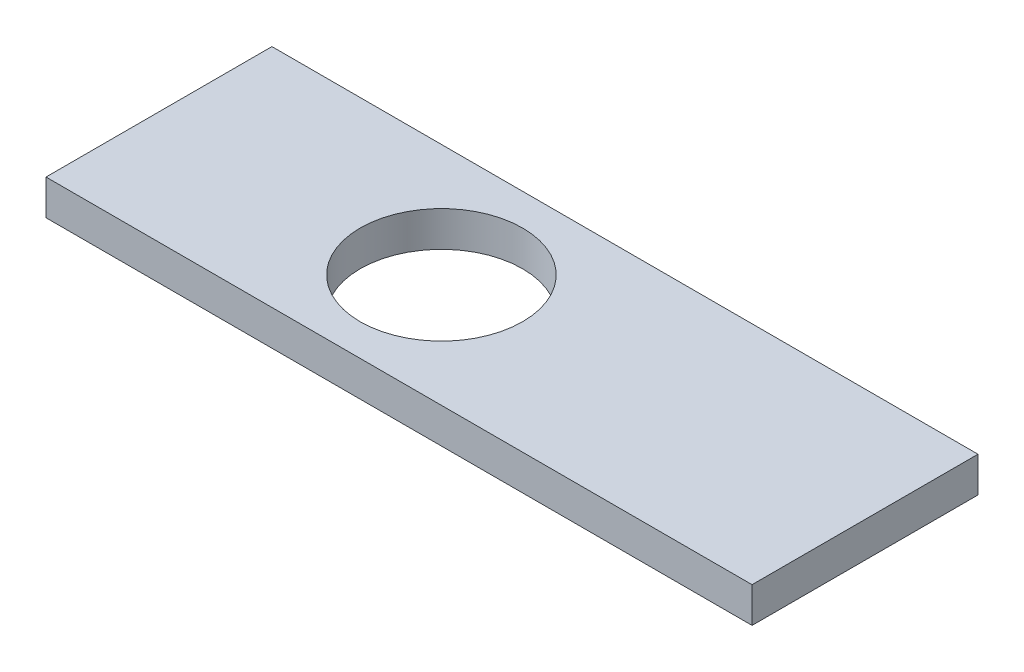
ISO-10303-21;
HEADER;
FILE_DESCRIPTION(('STEP AP214'),'2;1');
FILE_NAME('part.step','',(''),(''),'','','');
FILE_SCHEMA(('AUTOMOTIVE_DESIGN { 1 0 10303 214 1 1 1 1 }'));
ENDSEC;
DATA;
#1=APPLICATION_CONTEXT('core data for automotive mechanical design processes');
#2=APPLICATION_PROTOCOL_DEFINITION('international standard','automotive_design',2000,#1);
#3=PRODUCT_CONTEXT('',#1,'mechanical');
#4=PRODUCT('Part','Part','',(#3));
#5=PRODUCT_RELATED_PRODUCT_CATEGORY('part','',(#4));
#6=PRODUCT_DEFINITION_FORMATION('','',#4);
#7=PRODUCT_DEFINITION_CONTEXT('part definition',#1,'design');
#8=PRODUCT_DEFINITION('design','',#6,#7);
#9=PRODUCT_DEFINITION_SHAPE('','',#8);
#10=(LENGTH_UNIT() NAMED_UNIT(*) SI_UNIT(.MILLI.,.METRE.));
#11=(NAMED_UNIT(*) PLANE_ANGLE_UNIT() SI_UNIT($,.RADIAN.));
#12=(NAMED_UNIT(*) SI_UNIT($,.STERADIAN.) SOLID_ANGLE_UNIT());
#13=UNCERTAINTY_MEASURE_WITH_UNIT(LENGTH_MEASURE(1.E-05),#10,'distance_accuracy_value','');
#14=(GEOMETRIC_REPRESENTATION_CONTEXT(3) GLOBAL_UNCERTAINTY_ASSIGNED_CONTEXT((#13)) GLOBAL_UNIT_ASSIGNED_CONTEXT((#10,
#11,#12)) REPRESENTATION_CONTEXT('',''));
#15=CARTESIAN_POINT('',(0.,0.,0.));
#16=DIRECTION('',(0.,0.,1.));
#17=DIRECTION('',(1.,0.,0.));
#18=AXIS2_PLACEMENT_3D('',#15,#16,#17);
#19=CARTESIAN_POINT('',(-50.8,-6.35,20.32));
#20=DIRECTION('',(-1.,0.,0.));
#21=DIRECTION('',(0.,0.,1.));
#22=AXIS2_PLACEMENT_3D('',#19,#20,#21);
#23=PLANE('',#22);
#24=DIRECTION('',(0.,0.,1.));
#25=VECTOR('',#24,1.);
#26=CARTESIAN_POINT('',(-50.8,0.,20.32));
#27=LINE('',#26,#25);
#28=CARTESIAN_POINT('',(-50.8,0.,-20.32));
#29=VERTEX_POINT('',#28);
#30=CARTESIAN_POINT('',(-50.8,0.,20.32));
#31=VERTEX_POINT('',#30);
#32=EDGE_CURVE('E102',#29,#31,#27,.T.);
#33=ORIENTED_EDGE('',*,*,#32,.F.);
#34=DIRECTION('',(0.,1.,0.));
#35=VECTOR('',#34,1.);
#36=CARTESIAN_POINT('',(-50.8,-6.35,-20.32));
#37=LINE('',#36,#35);
#38=CARTESIAN_POINT('',(-50.8,-6.35,-20.32));
#39=VERTEX_POINT('',#38);
#40=EDGE_CURVE('E11',#39,#29,#37,.T.);
#41=ORIENTED_EDGE('',*,*,#40,.F.);
#42=DIRECTION('',(0.,0.,1.));
#43=VECTOR('',#42,1.);
#44=CARTESIAN_POINT('',(-50.8,-6.35,20.32));
#45=LINE('',#44,#43);
#46=CARTESIAN_POINT('',(-50.8,-6.35,20.32));
#47=VERTEX_POINT('',#46);
#48=EDGE_CURVE('E95',#39,#47,#45,.T.);
#49=ORIENTED_EDGE('',*,*,#48,.T.);
#50=DIRECTION('',(0.,1.,0.));
#51=VECTOR('',#50,1.);
#52=CARTESIAN_POINT('',(-50.8,-6.35,20.32));
#53=LINE('',#52,#51);
#54=EDGE_CURVE('E40',#47,#31,#53,.T.);
#55=ORIENTED_EDGE('',*,*,#54,.T.);
#56=EDGE_LOOP('',(#33,#41,#49,#55));
#57=FACE_BOUND('',#56,.T.);
#58=ADVANCED_FACE('F37',(#57),#23,.T.);
#59=CARTESIAN_POINT('',(-50.8,-6.35,-20.32));
#60=DIRECTION('',(0.,0.,-1.));
#61=DIRECTION('',(-1.,0.,0.));
#62=AXIS2_PLACEMENT_3D('',#59,#60,#61);
#63=PLANE('',#62);
#64=DIRECTION('',(-1.,0.,0.));
#65=VECTOR('',#64,1.);
#66=CARTESIAN_POINT('',(-50.8,0.,-20.32));
#67=LINE('',#66,#65);
#68=CARTESIAN_POINT('',(76.2,0.,-20.32));
#69=VERTEX_POINT('',#68);
#70=EDGE_CURVE('E97',#69,#29,#67,.T.);
#71=ORIENTED_EDGE('',*,*,#70,.F.);
#72=DIRECTION('',(0.,1.,0.));
#73=VECTOR('',#72,1.);
#74=CARTESIAN_POINT('',(76.2,-6.35,-20.32));
#75=LINE('',#74,#73);
#76=CARTESIAN_POINT('',(76.2,-6.35,-20.32));
#77=VERTEX_POINT('',#76);
#78=EDGE_CURVE('E46',#77,#69,#75,.T.);
#79=ORIENTED_EDGE('',*,*,#78,.F.);
#80=DIRECTION('',(-1.,0.,0.));
#81=VECTOR('',#80,1.);
#82=CARTESIAN_POINT('',(-50.8,-6.35,-20.32));
#83=LINE('',#82,#81);
#84=EDGE_CURVE('E92',#77,#39,#83,.T.);
#85=ORIENTED_EDGE('',*,*,#84,.T.);
#86=ORIENTED_EDGE('',*,*,#40,.T.);
#87=EDGE_LOOP('',(#71,#79,#85,#86));
#88=FACE_BOUND('',#87,.T.);
#89=ADVANCED_FACE('F113',(#88),#63,.T.);
#90=CARTESIAN_POINT('',(76.2,-6.35,20.32));
#91=DIRECTION('',(1.,0.,0.));
#92=DIRECTION('',(0.,0.,-1.));
#93=AXIS2_PLACEMENT_3D('',#90,#91,#92);
#94=PLANE('',#93);
#95=DIRECTION('',(0.,0.,-1.));
#96=VECTOR('',#95,1.);
#97=CARTESIAN_POINT('',(76.2,0.,20.32));
#98=LINE('',#97,#96);
#99=CARTESIAN_POINT('',(76.2,0.,20.32));
#100=VERTEX_POINT('',#99);
#101=EDGE_CURVE('E87',#100,#69,#98,.T.);
#102=ORIENTED_EDGE('',*,*,#101,.F.);
#103=DIRECTION('',(0.,1.,0.));
#104=VECTOR('',#103,1.);
#105=CARTESIAN_POINT('',(76.2,-6.35,20.32));
#106=LINE('',#105,#104);
#107=CARTESIAN_POINT('',(76.2,-6.35,20.32));
#108=VERTEX_POINT('',#107);
#109=EDGE_CURVE('E82',#108,#100,#106,.T.);
#110=ORIENTED_EDGE('',*,*,#109,.F.);
#111=DIRECTION('',(0.,0.,-1.));
#112=VECTOR('',#111,1.);
#113=CARTESIAN_POINT('',(76.2,-6.35,20.32));
#114=LINE('',#113,#112);
#115=EDGE_CURVE('E85',#108,#77,#114,.T.);
#116=ORIENTED_EDGE('',*,*,#115,.T.);
#117=ORIENTED_EDGE('',*,*,#78,.T.);
#118=EDGE_LOOP('',(#102,#110,#116,#117));
#119=FACE_BOUND('',#118,.T.);
#120=ADVANCED_FACE('F84',(#119),#94,.T.);
#121=CARTESIAN_POINT('',(-50.8,-6.35,20.32));
#122=DIRECTION('',(0.,0.,1.));
#123=DIRECTION('',(1.,0.,0.));
#124=AXIS2_PLACEMENT_3D('',#121,#122,#123);
#125=PLANE('',#124);
#126=DIRECTION('',(1.,0.,0.));
#127=VECTOR('',#126,1.);
#128=CARTESIAN_POINT('',(-50.8,0.,20.32));
#129=LINE('',#128,#127);
#130=EDGE_CURVE('E105',#31,#100,#129,.T.);
#131=ORIENTED_EDGE('',*,*,#130,.F.);
#132=ORIENTED_EDGE('',*,*,#54,.F.);
#133=DIRECTION('',(1.,0.,0.));
#134=VECTOR('',#133,1.);
#135=CARTESIAN_POINT('',(-50.8,-6.35,20.32));
#136=LINE('',#135,#134);
#137=EDGE_CURVE('E91',#47,#108,#136,.T.);
#138=ORIENTED_EDGE('',*,*,#137,.T.);
#139=ORIENTED_EDGE('',*,*,#109,.T.);
#140=EDGE_LOOP('',(#131,#132,#138,#139));
#141=FACE_BOUND('',#140,.T.);
#142=ADVANCED_FACE('F94',(#141),#125,.T.);
#143=CARTESIAN_POINT('',(0.,-6.35,0.));
#144=DIRECTION('',(0.,-1.,0.));
#145=DIRECTION('',(0.,0.,-1.));
#146=AXIS2_PLACEMENT_3D('',#143,#144,#145);
#147=PLANE('',#146);
#148=CARTESIAN_POINT('',(0.,-6.35,0.));
#149=DIRECTION('',(0.,1.,0.));
#150=DIRECTION('',(0.,0.,1.));
#151=AXIS2_PLACEMENT_3D('',#148,#149,#150);
#152=CIRCLE('',#151,14.605);
#153=CARTESIAN_POINT('',(0.,-6.35,14.605));
#154=VERTEX_POINT('',#153);
#155=EDGE_CURVE('E106',#154,#154,#152,.T.);
#156=ORIENTED_EDGE('',*,*,#155,.T.);
#157=EDGE_LOOP('',(#156));
#158=FACE_BOUND('',#157,.T.);
#159=ORIENTED_EDGE('',*,*,#48,.F.);
#160=ORIENTED_EDGE('',*,*,#84,.F.);
#161=ORIENTED_EDGE('',*,*,#115,.F.);
#162=ORIENTED_EDGE('',*,*,#137,.F.);
#163=EDGE_LOOP('',(#159,#160,#161,#162));
#164=FACE_BOUND('',#163,.T.);
#165=ADVANCED_FACE('F90',(#158,#164),#147,.T.);
#166=CARTESIAN_POINT('',(0.,0.,0.));
#167=DIRECTION('',(0.,-1.,0.));
#168=DIRECTION('',(0.,0.,-1.));
#169=AXIS2_PLACEMENT_3D('',#166,#167,#168);
#170=PLANE('',#169);
#171=CARTESIAN_POINT('',(0.,0.,0.));
#172=DIRECTION('',(0.,1.,0.));
#173=DIRECTION('',(0.,0.,1.));
#174=AXIS2_PLACEMENT_3D('',#171,#172,#173);
#175=CIRCLE('',#174,14.605);
#176=CARTESIAN_POINT('',(0.,0.,14.605));
#177=VERTEX_POINT('',#176);
#178=EDGE_CURVE('E143',#177,#177,#175,.T.);
#179=ORIENTED_EDGE('',*,*,#178,.F.);
#180=EDGE_LOOP('',(#179));
#181=FACE_BOUND('',#180,.T.);
#182=ORIENTED_EDGE('',*,*,#32,.T.);
#183=ORIENTED_EDGE('',*,*,#130,.T.);
#184=ORIENTED_EDGE('',*,*,#101,.T.);
#185=ORIENTED_EDGE('',*,*,#70,.T.);
#186=EDGE_LOOP('',(#182,#183,#184,#185));
#187=FACE_BOUND('',#186,.T.);
#188=ADVANCED_FACE('F112',(#181,#187),#170,.F.);
#189=CARTESIAN_POINT('',(0.,-6.35,0.));
#190=DIRECTION('',(0.,1.,0.));
#191=DIRECTION('',(0.,0.,1.));
#192=AXIS2_PLACEMENT_3D('',#189,#190,#191);
#193=CYLINDRICAL_SURFACE('',#192,14.605);
#194=ORIENTED_EDGE('',*,*,#155,.F.);
#195=EDGE_LOOP('',(#194));
#196=FACE_BOUND('',#195,.T.);
#197=ORIENTED_EDGE('',*,*,#178,.T.);
#198=EDGE_LOOP('',(#197));
#199=FACE_BOUND('',#198,.T.);
#200=ADVANCED_FACE('F131',(#196,#199),#193,.F.);
#201=CLOSED_SHELL('',(#58,#89,#120,#142,#165,#188,#200));
#202=MANIFOLD_SOLID_BREP('B2',#201);
#203=ADVANCED_BREP_SHAPE_REPRESENTATION('',(#18,#202),#14);
#204=SHAPE_DEFINITION_REPRESENTATION(#9,#203);
ENDSEC;
END-ISO-10303-21;
